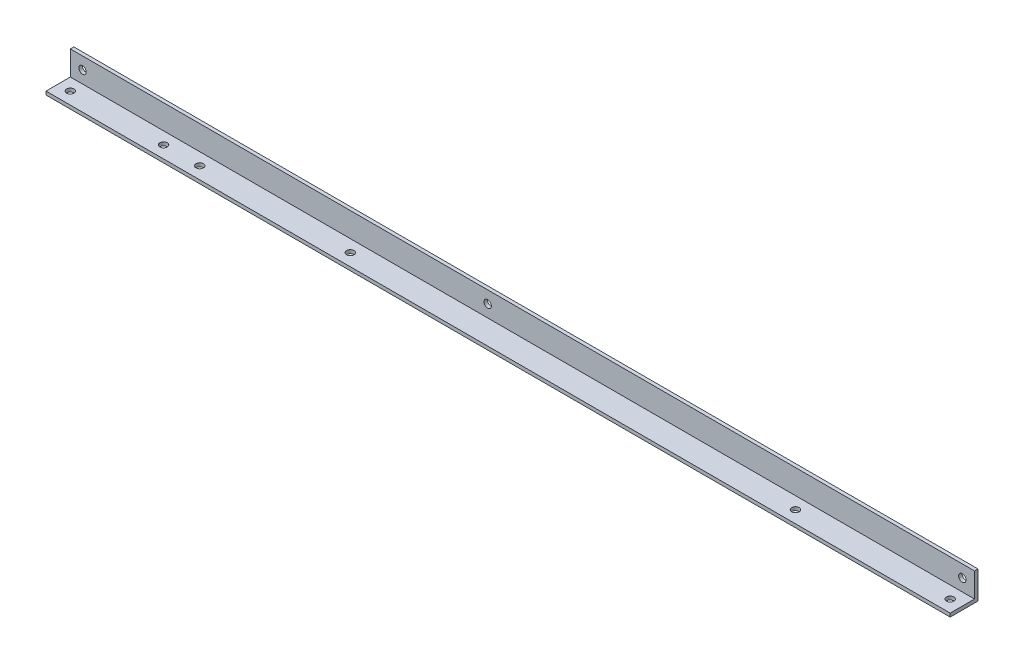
ISO-10303-21;
HEADER;
FILE_DESCRIPTION(('STEP AP214'),'2;1');
FILE_NAME('part.step','',(''),(''),'','','');
FILE_SCHEMA(('AUTOMOTIVE_DESIGN { 1 0 10303 214 1 1 1 1 }'));
ENDSEC;
DATA;
#1=APPLICATION_CONTEXT('core data for automotive mechanical design processes');
#2=APPLICATION_PROTOCOL_DEFINITION('international standard','automotive_design',2000,#1);
#3=PRODUCT_CONTEXT('',#1,'mechanical');
#4=PRODUCT('Part','Part','',(#3));
#5=PRODUCT_RELATED_PRODUCT_CATEGORY('part','',(#4));
#6=PRODUCT_DEFINITION_FORMATION('','',#4);
#7=PRODUCT_DEFINITION_CONTEXT('part definition',#1,'design');
#8=PRODUCT_DEFINITION('design','',#6,#7);
#9=PRODUCT_DEFINITION_SHAPE('','',#8);
#10=(LENGTH_UNIT() NAMED_UNIT(*) SI_UNIT(.MILLI.,.METRE.));
#11=(NAMED_UNIT(*) PLANE_ANGLE_UNIT() SI_UNIT($,.RADIAN.));
#12=(NAMED_UNIT(*) SI_UNIT($,.STERADIAN.) SOLID_ANGLE_UNIT());
#13=UNCERTAINTY_MEASURE_WITH_UNIT(LENGTH_MEASURE(1.E-05),#10,'distance_accuracy_value','');
#14=(GEOMETRIC_REPRESENTATION_CONTEXT(3) GLOBAL_UNCERTAINTY_ASSIGNED_CONTEXT((#13)) GLOBAL_UNIT_ASSIGNED_CONTEXT((#10,
#11,#12)) REPRESENTATION_CONTEXT('',''));
#15=CARTESIAN_POINT('',(0.,0.,0.));
#16=DIRECTION('',(0.,0.,1.));
#17=DIRECTION('',(1.,0.,0.));
#18=AXIS2_PLACEMENT_3D('',#15,#16,#17);
#19=CARTESIAN_POINT('',(412.75,3.175,-12.7));
#20=DIRECTION('',(-1.,0.,0.));
#21=DIRECTION('',(0.,0.,1.));
#22=AXIS2_PLACEMENT_3D('',#19,#20,#21);
#23=PLANE('',#22);
#24=DIRECTION('',(0.,0.,-1.));
#25=VECTOR('',#24,1.);
#26=CARTESIAN_POINT('',(412.75,0.,-12.7));
#27=LINE('',#26,#25);
#28=CARTESIAN_POINT('',(412.75,0.,12.7));
#29=VERTEX_POINT('',#28);
#30=CARTESIAN_POINT('',(412.75,0.,-12.7));
#31=VERTEX_POINT('',#30);
#32=EDGE_CURVE('E89',#29,#31,#27,.T.);
#33=ORIENTED_EDGE('',*,*,#32,.T.);
#34=DIRECTION('',(0.,-1.,0.));
#35=VECTOR('',#34,1.);
#36=CARTESIAN_POINT('',(412.75,3.175,-12.7));
#37=LINE('',#36,#35);
#38=CARTESIAN_POINT('',(412.75,25.4,-12.7));
#39=VERTEX_POINT('',#38);
#40=EDGE_CURVE('E11',#39,#31,#37,.T.);
#41=ORIENTED_EDGE('',*,*,#40,.F.);
#42=DIRECTION('',(0.,0.,-1.));
#43=VECTOR('',#42,1.);
#44=CARTESIAN_POINT('',(412.75,25.4,-9.525));
#45=LINE('',#44,#43);
#46=CARTESIAN_POINT('',(412.75,25.4,-9.525));
#47=VERTEX_POINT('',#46);
#48=EDGE_CURVE('E115',#47,#39,#45,.T.);
#49=ORIENTED_EDGE('',*,*,#48,.F.);
#50=DIRECTION('',(0.,-1.,0.));
#51=VECTOR('',#50,1.);
#52=CARTESIAN_POINT('',(412.75,25.4,-9.525));
#53=LINE('',#52,#51);
#54=CARTESIAN_POINT('',(412.75,3.175,-9.525));
#55=VERTEX_POINT('',#54);
#56=EDGE_CURVE('E98',#47,#55,#53,.T.);
#57=ORIENTED_EDGE('',*,*,#56,.T.);
#58=DIRECTION('',(0.,0.,-1.));
#59=VECTOR('',#58,1.);
#60=CARTESIAN_POINT('',(412.75,3.175,-12.7));
#61=LINE('',#60,#59);
#62=CARTESIAN_POINT('',(412.75,3.175,12.7));
#63=VERTEX_POINT('',#62);
#64=EDGE_CURVE('E83',#63,#55,#61,.T.);
#65=ORIENTED_EDGE('',*,*,#64,.F.);
#66=DIRECTION('',(0.,-1.,0.));
#67=VECTOR('',#66,1.);
#68=CARTESIAN_POINT('',(412.75,3.175,12.7));
#69=LINE('',#68,#67);
#70=EDGE_CURVE('E76',#63,#29,#69,.T.);
#71=ORIENTED_EDGE('',*,*,#70,.T.);
#72=EDGE_LOOP('',(#33,#41,#49,#57,#65,#71));
#73=FACE_BOUND('',#72,.T.);
#74=ADVANCED_FACE('F32',(#73),#23,.F.);
#75=CARTESIAN_POINT('',(-412.75,3.175,-12.7));
#76=DIRECTION('',(0.,0.,1.));
#77=DIRECTION('',(1.,0.,0.));
#78=AXIS2_PLACEMENT_3D('',#75,#76,#77);
#79=PLANE('',#78);
#80=CARTESIAN_POINT('',(-31.75,14.2875,-12.7));
#81=DIRECTION('',(0.,0.,1.));
#82=DIRECTION('',(1.,0.,0.));
#83=AXIS2_PLACEMENT_3D('',#80,#81,#82);
#84=CIRCLE('',#83,3.37819999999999);
#85=CARTESIAN_POINT('',(-28.3718,14.2875,-12.7));
#86=VERTEX_POINT('',#85);
#87=EDGE_CURVE('E183',#86,#86,#84,.T.);
#88=ORIENTED_EDGE('',*,*,#87,.T.);
#89=EDGE_LOOP('',(#88));
#90=FACE_BOUND('',#89,.T.);
#91=CARTESIAN_POINT('',(401.6375,14.2875,-12.7));
#92=DIRECTION('',(0.,0.,1.));
#93=DIRECTION('',(1.,0.,0.));
#94=AXIS2_PLACEMENT_3D('',#91,#92,#93);
#95=CIRCLE('',#94,3.37819999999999);
#96=CARTESIAN_POINT('',(405.0157,14.2875,-12.7));
#97=VERTEX_POINT('',#96);
#98=EDGE_CURVE('E177',#97,#97,#95,.T.);
#99=ORIENTED_EDGE('',*,*,#98,.T.);
#100=EDGE_LOOP('',(#99));
#101=FACE_BOUND('',#100,.T.);
#102=CARTESIAN_POINT('',(-401.6375,14.2875,-12.7));
#103=DIRECTION('',(0.,0.,1.));
#104=DIRECTION('',(1.,0.,0.));
#105=AXIS2_PLACEMENT_3D('',#102,#103,#104);
#106=CIRCLE('',#105,3.37819999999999);
#107=CARTESIAN_POINT('',(-398.2593,14.2875,-12.7));
#108=VERTEX_POINT('',#107);
#109=EDGE_CURVE('E171',#108,#108,#106,.T.);
#110=ORIENTED_EDGE('',*,*,#109,.T.);
#111=EDGE_LOOP('',(#110));
#112=FACE_BOUND('',#111,.T.);
#113=DIRECTION('',(-1.,0.,0.));
#114=VECTOR('',#113,1.);
#115=CARTESIAN_POINT('',(-412.75,0.,-12.7));
#116=LINE('',#115,#114);
#117=CARTESIAN_POINT('',(-412.75,0.,-12.7));
#118=VERTEX_POINT('',#117);
#119=EDGE_CURVE('E93',#31,#118,#116,.T.);
#120=ORIENTED_EDGE('',*,*,#119,.T.);
#121=DIRECTION('',(0.,-1.,0.));
#122=VECTOR('',#121,1.);
#123=CARTESIAN_POINT('',(-412.75,3.175,-12.7));
#124=LINE('',#123,#122);
#125=CARTESIAN_POINT('',(-412.75,25.4,-12.7));
#126=VERTEX_POINT('',#125);
#127=EDGE_CURVE('E40',#126,#118,#124,.T.);
#128=ORIENTED_EDGE('',*,*,#127,.F.);
#129=DIRECTION('',(-1.,0.,0.));
#130=VECTOR('',#129,1.);
#131=CARTESIAN_POINT('',(412.75,25.4,-12.7));
#132=LINE('',#131,#130);
#133=EDGE_CURVE('E118',#39,#126,#132,.T.);
#134=ORIENTED_EDGE('',*,*,#133,.F.);
#135=ORIENTED_EDGE('',*,*,#40,.T.);
#136=EDGE_LOOP('',(#120,#128,#134,#135));
#137=FACE_BOUND('',#136,.T.);
#138=ADVANCED_FACE('F192',(#90,#101,#112,#137),#79,.F.);
#139=CARTESIAN_POINT('',(-412.75,3.175,-12.7));
#140=DIRECTION('',(1.,0.,0.));
#141=DIRECTION('',(0.,0.,-1.));
#142=AXIS2_PLACEMENT_3D('',#139,#140,#141);
#143=PLANE('',#142);
#144=DIRECTION('',(0.,0.,1.));
#145=VECTOR('',#144,1.);
#146=CARTESIAN_POINT('',(-412.75,0.,-12.7));
#147=LINE('',#146,#145);
#148=CARTESIAN_POINT('',(-412.75,0.,12.7));
#149=VERTEX_POINT('',#148);
#150=EDGE_CURVE('E84',#118,#149,#147,.T.);
#151=ORIENTED_EDGE('',*,*,#150,.T.);
#152=DIRECTION('',(0.,-1.,0.));
#153=VECTOR('',#152,1.);
#154=CARTESIAN_POINT('',(-412.75,3.175,12.7));
#155=LINE('',#154,#153);
#156=CARTESIAN_POINT('',(-412.75,3.175,12.7));
#157=VERTEX_POINT('',#156);
#158=EDGE_CURVE('E79',#157,#149,#155,.T.);
#159=ORIENTED_EDGE('',*,*,#158,.F.);
#160=DIRECTION('',(0.,0.,1.));
#161=VECTOR('',#160,1.);
#162=CARTESIAN_POINT('',(-412.75,3.175,-12.7));
#163=LINE('',#162,#161);
#164=CARTESIAN_POINT('',(-412.75,3.175,-9.525));
#165=VERTEX_POINT('',#164);
#166=EDGE_CURVE('E108',#165,#157,#163,.T.);
#167=ORIENTED_EDGE('',*,*,#166,.F.);
#168=DIRECTION('',(0.,-1.,0.));
#169=VECTOR('',#168,1.);
#170=CARTESIAN_POINT('',(-412.75,25.4,-9.525));
#171=LINE('',#170,#169);
#172=CARTESIAN_POINT('',(-412.75,25.4,-9.525));
#173=VERTEX_POINT('',#172);
#174=EDGE_CURVE('E94',#173,#165,#171,.T.);
#175=ORIENTED_EDGE('',*,*,#174,.F.);
#176=DIRECTION('',(0.,0.,1.));
#177=VECTOR('',#176,1.);
#178=CARTESIAN_POINT('',(-412.75,25.4,-12.7));
#179=LINE('',#178,#177);
#180=EDGE_CURVE('E131',#126,#173,#179,.T.);
#181=ORIENTED_EDGE('',*,*,#180,.F.);
#182=ORIENTED_EDGE('',*,*,#127,.T.);
#183=EDGE_LOOP('',(#151,#159,#167,#175,#181,#182));
#184=FACE_BOUND('',#183,.T.);
#185=ADVANCED_FACE('F221',(#184),#143,.F.);
#186=CARTESIAN_POINT('',(-412.75,3.175,12.7));
#187=DIRECTION('',(0.,0.,-1.));
#188=DIRECTION('',(-1.,0.,0.));
#189=AXIS2_PLACEMENT_3D('',#186,#187,#188);
#190=PLANE('',#189);
#191=DIRECTION('',(1.,0.,0.));
#192=VECTOR('',#191,1.);
#193=CARTESIAN_POINT('',(-412.75,0.,12.7));
#194=LINE('',#193,#192);
#195=EDGE_CURVE('E73',#149,#29,#194,.T.);
#196=ORIENTED_EDGE('',*,*,#195,.T.);
#197=ORIENTED_EDGE('',*,*,#70,.F.);
#198=DIRECTION('',(1.,0.,0.));
#199=VECTOR('',#198,1.);
#200=CARTESIAN_POINT('',(-412.75,3.175,12.7));
#201=LINE('',#200,#199);
#202=EDGE_CURVE('E54',#157,#63,#201,.T.);
#203=ORIENTED_EDGE('',*,*,#202,.F.);
#204=ORIENTED_EDGE('',*,*,#158,.T.);
#205=EDGE_LOOP('',(#196,#197,#203,#204));
#206=FACE_BOUND('',#205,.T.);
#207=ADVANCED_FACE('F75',(#206),#190,.F.);
#208=CARTESIAN_POINT('',(412.75,3.175,12.7));
#209=DIRECTION('',(0.,1.,0.));
#210=DIRECTION('',(0.,0.,1.));
#211=AXIS2_PLACEMENT_3D('',#208,#209,#210);
#212=PLANE('',#211);
#213=CARTESIAN_POINT('',(-146.05,3.175,1.5875));
#214=DIRECTION('',(0.,1.,0.));
#215=DIRECTION('',(0.,0.,1.));
#216=AXIS2_PLACEMENT_3D('',#213,#214,#215);
#217=CIRCLE('',#216,3.37819999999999);
#218=CARTESIAN_POINT('',(-146.05,3.175,4.96569999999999));
#219=VERTEX_POINT('',#218);
#220=EDGE_CURVE('E168',#219,#219,#217,.T.);
#221=ORIENTED_EDGE('',*,*,#220,.F.);
#222=EDGE_LOOP('',(#221));
#223=FACE_BOUND('',#222,.T.);
#224=CARTESIAN_POINT('',(-283.5275,3.175,1.5875));
#225=DIRECTION('',(0.,1.,0.));
#226=DIRECTION('',(0.,0.,1.));
#227=AXIS2_PLACEMENT_3D('',#224,#225,#226);
#228=CIRCLE('',#227,3.37819999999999);
#229=CARTESIAN_POINT('',(-283.5275,3.175,4.96569999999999));
#230=VERTEX_POINT('',#229);
#231=EDGE_CURVE('E162',#230,#230,#228,.T.);
#232=ORIENTED_EDGE('',*,*,#231,.F.);
#233=EDGE_LOOP('',(#232));
#234=FACE_BOUND('',#233,.T.);
#235=CARTESIAN_POINT('',(260.35,3.175,1.5875));
#236=DIRECTION('',(0.,1.,0.));
#237=DIRECTION('',(0.,0.,1.));
#238=AXIS2_PLACEMENT_3D('',#235,#236,#237);
#239=CIRCLE('',#238,3.37819999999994);
#240=CARTESIAN_POINT('',(260.35,3.175,4.96569999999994));
#241=VERTEX_POINT('',#240);
#242=EDGE_CURVE('E156',#241,#241,#239,.T.);
#243=ORIENTED_EDGE('',*,*,#242,.F.);
#244=EDGE_LOOP('',(#243));
#245=FACE_BOUND('',#244,.T.);
#246=CARTESIAN_POINT('',(401.6375,3.175,1.5875));
#247=DIRECTION('',(0.,1.,0.));
#248=DIRECTION('',(0.,0.,1.));
#249=AXIS2_PLACEMENT_3D('',#246,#247,#248);
#250=CIRCLE('',#249,3.37819999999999);
#251=CARTESIAN_POINT('',(401.6375,3.175,4.96569999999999));
#252=VERTEX_POINT('',#251);
#253=EDGE_CURVE('E150',#252,#252,#250,.T.);
#254=ORIENTED_EDGE('',*,*,#253,.F.);
#255=EDGE_LOOP('',(#254));
#256=FACE_BOUND('',#255,.T.);
#257=CARTESIAN_POINT('',(-316.5475,3.175,1.5875));
#258=DIRECTION('',(0.,1.,0.));
#259=DIRECTION('',(0.,0.,1.));
#260=AXIS2_PLACEMENT_3D('',#257,#258,#259);
#261=CIRCLE('',#260,3.37819999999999);
#262=CARTESIAN_POINT('',(-316.5475,3.175,4.96569999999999));
#263=VERTEX_POINT('',#262);
#264=EDGE_CURVE('E144',#263,#263,#261,.T.);
#265=ORIENTED_EDGE('',*,*,#264,.F.);
#266=EDGE_LOOP('',(#265));
#267=FACE_BOUND('',#266,.T.);
#268=CARTESIAN_POINT('',(-401.6375,3.175,1.5875));
#269=DIRECTION('',(0.,1.,0.));
#270=DIRECTION('',(0.,0.,1.));
#271=AXIS2_PLACEMENT_3D('',#268,#269,#270);
#272=CIRCLE('',#271,3.37819999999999);
#273=CARTESIAN_POINT('',(-401.6375,3.175,4.96569999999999));
#274=VERTEX_POINT('',#273);
#275=EDGE_CURVE('E138',#274,#274,#272,.T.);
#276=ORIENTED_EDGE('',*,*,#275,.F.);
#277=EDGE_LOOP('',(#276));
#278=FACE_BOUND('',#277,.T.);
#279=DIRECTION('',(1.,0.,0.));
#280=VECTOR('',#279,1.);
#281=CARTESIAN_POINT('',(-412.75,3.175,-9.525));
#282=LINE('',#281,#280);
#283=EDGE_CURVE('E48',#165,#55,#282,.T.);
#284=ORIENTED_EDGE('',*,*,#283,.F.);
#285=ORIENTED_EDGE('',*,*,#166,.T.);
#286=ORIENTED_EDGE('',*,*,#202,.T.);
#287=ORIENTED_EDGE('',*,*,#64,.T.);
#288=EDGE_LOOP('',(#284,#285,#286,#287));
#289=FACE_BOUND('',#288,.T.);
#290=ADVANCED_FACE('F222',(#223,#234,#245,#256,#267,#278,#289),#212,.T.);
#291=CARTESIAN_POINT('',(412.75,0.,12.7));
#292=DIRECTION('',(0.,1.,0.));
#293=DIRECTION('',(0.,0.,1.));
#294=AXIS2_PLACEMENT_3D('',#291,#292,#293);
#295=PLANE('',#294);
#296=CARTESIAN_POINT('',(-146.05,0.,1.5875));
#297=DIRECTION('',(0.,1.,0.));
#298=DIRECTION('',(0.,0.,1.));
#299=AXIS2_PLACEMENT_3D('',#296,#297,#298);
#300=CIRCLE('',#299,3.37819999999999);
#301=CARTESIAN_POINT('',(-146.05,0.,4.96569999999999));
#302=VERTEX_POINT('',#301);
#303=EDGE_CURVE('E165',#302,#302,#300,.T.);
#304=ORIENTED_EDGE('',*,*,#303,.T.);
#305=EDGE_LOOP('',(#304));
#306=FACE_BOUND('',#305,.T.);
#307=CARTESIAN_POINT('',(-283.5275,0.,1.5875));
#308=DIRECTION('',(0.,1.,0.));
#309=DIRECTION('',(0.,0.,1.));
#310=AXIS2_PLACEMENT_3D('',#307,#308,#309);
#311=CIRCLE('',#310,3.37819999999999);
#312=CARTESIAN_POINT('',(-283.5275,0.,4.96569999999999));
#313=VERTEX_POINT('',#312);
#314=EDGE_CURVE('E159',#313,#313,#311,.T.);
#315=ORIENTED_EDGE('',*,*,#314,.T.);
#316=EDGE_LOOP('',(#315));
#317=FACE_BOUND('',#316,.T.);
#318=CARTESIAN_POINT('',(260.35,0.,1.5875));
#319=DIRECTION('',(0.,1.,0.));
#320=DIRECTION('',(0.,0.,1.));
#321=AXIS2_PLACEMENT_3D('',#318,#319,#320);
#322=CIRCLE('',#321,3.37819999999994);
#323=CARTESIAN_POINT('',(260.35,0.,4.96569999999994));
#324=VERTEX_POINT('',#323);
#325=EDGE_CURVE('E153',#324,#324,#322,.T.);
#326=ORIENTED_EDGE('',*,*,#325,.T.);
#327=EDGE_LOOP('',(#326));
#328=FACE_BOUND('',#327,.T.);
#329=CARTESIAN_POINT('',(401.6375,0.,1.5875));
#330=DIRECTION('',(0.,1.,0.));
#331=DIRECTION('',(0.,0.,1.));
#332=AXIS2_PLACEMENT_3D('',#329,#330,#331);
#333=CIRCLE('',#332,3.37819999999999);
#334=CARTESIAN_POINT('',(401.6375,0.,4.96569999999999));
#335=VERTEX_POINT('',#334);
#336=EDGE_CURVE('E147',#335,#335,#333,.T.);
#337=ORIENTED_EDGE('',*,*,#336,.T.);
#338=EDGE_LOOP('',(#337));
#339=FACE_BOUND('',#338,.T.);
#340=CARTESIAN_POINT('',(-316.5475,0.,1.5875));
#341=DIRECTION('',(0.,1.,0.));
#342=DIRECTION('',(0.,0.,1.));
#343=AXIS2_PLACEMENT_3D('',#340,#341,#342);
#344=CIRCLE('',#343,3.37819999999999);
#345=CARTESIAN_POINT('',(-316.5475,0.,4.96569999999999));
#346=VERTEX_POINT('',#345);
#347=EDGE_CURVE('E141',#346,#346,#344,.T.);
#348=ORIENTED_EDGE('',*,*,#347,.T.);
#349=EDGE_LOOP('',(#348));
#350=FACE_BOUND('',#349,.T.);
#351=CARTESIAN_POINT('',(-401.6375,0.,1.5875));
#352=DIRECTION('',(0.,1.,0.));
#353=DIRECTION('',(0.,0.,1.));
#354=AXIS2_PLACEMENT_3D('',#351,#352,#353);
#355=CIRCLE('',#354,3.37819999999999);
#356=CARTESIAN_POINT('',(-401.6375,0.,4.96569999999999));
#357=VERTEX_POINT('',#356);
#358=EDGE_CURVE('E119',#357,#357,#355,.T.);
#359=ORIENTED_EDGE('',*,*,#358,.T.);
#360=EDGE_LOOP('',(#359));
#361=FACE_BOUND('',#360,.T.);
#362=ORIENTED_EDGE('',*,*,#32,.F.);
#363=ORIENTED_EDGE('',*,*,#195,.F.);
#364=ORIENTED_EDGE('',*,*,#150,.F.);
#365=ORIENTED_EDGE('',*,*,#119,.F.);
#366=EDGE_LOOP('',(#362,#363,#364,#365));
#367=FACE_BOUND('',#366,.T.);
#368=ADVANCED_FACE('F92',(#306,#317,#328,#339,#350,#361,#367),#295,.F.);
#369=CARTESIAN_POINT('',(-412.75,25.4,-9.525));
#370=DIRECTION('',(0.,0.,-1.));
#371=DIRECTION('',(-1.,0.,0.));
#372=AXIS2_PLACEMENT_3D('',#369,#370,#371);
#373=PLANE('',#372);
#374=CARTESIAN_POINT('',(-31.75,14.2875,-9.525));
#375=DIRECTION('',(0.,0.,1.));
#376=DIRECTION('',(1.,0.,0.));
#377=AXIS2_PLACEMENT_3D('',#374,#375,#376);
#378=CIRCLE('',#377,3.37819999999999);
#379=CARTESIAN_POINT('',(-28.3718,14.2875,-9.525));
#380=VERTEX_POINT('',#379);
#381=EDGE_CURVE('E186',#380,#380,#378,.T.);
#382=ORIENTED_EDGE('',*,*,#381,.F.);
#383=EDGE_LOOP('',(#382));
#384=FACE_BOUND('',#383,.T.);
#385=CARTESIAN_POINT('',(401.6375,14.2875,-9.525));
#386=DIRECTION('',(0.,0.,1.));
#387=DIRECTION('',(1.,0.,0.));
#388=AXIS2_PLACEMENT_3D('',#385,#386,#387);
#389=CIRCLE('',#388,3.37819999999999);
#390=CARTESIAN_POINT('',(405.0157,14.2875,-9.525));
#391=VERTEX_POINT('',#390);
#392=EDGE_CURVE('E180',#391,#391,#389,.T.);
#393=ORIENTED_EDGE('',*,*,#392,.F.);
#394=EDGE_LOOP('',(#393));
#395=FACE_BOUND('',#394,.T.);
#396=CARTESIAN_POINT('',(-401.6375,14.2875,-9.525));
#397=DIRECTION('',(0.,0.,1.));
#398=DIRECTION('',(1.,0.,0.));
#399=AXIS2_PLACEMENT_3D('',#396,#397,#398);
#400=CIRCLE('',#399,3.37819999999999);
#401=CARTESIAN_POINT('',(-398.2593,14.2875,-9.525));
#402=VERTEX_POINT('',#401);
#403=EDGE_CURVE('E174',#402,#402,#400,.T.);
#404=ORIENTED_EDGE('',*,*,#403,.F.);
#405=EDGE_LOOP('',(#404));
#406=FACE_BOUND('',#405,.T.);
#407=ORIENTED_EDGE('',*,*,#283,.T.);
#408=ORIENTED_EDGE('',*,*,#56,.F.);
#409=DIRECTION('',(1.,0.,0.));
#410=VECTOR('',#409,1.);
#411=CARTESIAN_POINT('',(-412.75,25.4,-9.525));
#412=LINE('',#411,#410);
#413=EDGE_CURVE('E126',#173,#47,#412,.T.);
#414=ORIENTED_EDGE('',*,*,#413,.F.);
#415=ORIENTED_EDGE('',*,*,#174,.T.);
#416=EDGE_LOOP('',(#407,#408,#414,#415));
#417=FACE_BOUND('',#416,.T.);
#418=ADVANCED_FACE('F202',(#384,#395,#406,#417),#373,.F.);
#419=CARTESIAN_POINT('',(-412.75,25.4,-12.7));
#420=DIRECTION('',(0.,1.,0.));
#421=DIRECTION('',(0.,0.,1.));
#422=AXIS2_PLACEMENT_3D('',#419,#420,#421);
#423=PLANE('',#422);
#424=ORIENTED_EDGE('',*,*,#133,.T.);
#425=ORIENTED_EDGE('',*,*,#180,.T.);
#426=ORIENTED_EDGE('',*,*,#413,.T.);
#427=ORIENTED_EDGE('',*,*,#48,.T.);
#428=EDGE_LOOP('',(#424,#425,#426,#427));
#429=FACE_BOUND('',#428,.T.);
#430=ADVANCED_FACE('F205',(#429),#423,.T.);
#431=CARTESIAN_POINT('',(-401.6375,0.,1.5875));
#432=DIRECTION('',(0.,1.,0.));
#433=DIRECTION('',(0.,0.,1.));
#434=AXIS2_PLACEMENT_3D('',#431,#432,#433);
#435=CYLINDRICAL_SURFACE('',#434,3.37819999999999);
#436=ORIENTED_EDGE('',*,*,#358,.F.);
#437=EDGE_LOOP('',(#436));
#438=FACE_BOUND('',#437,.T.);
#439=ORIENTED_EDGE('',*,*,#275,.T.);
#440=EDGE_LOOP('',(#439));
#441=FACE_BOUND('',#440,.T.);
#442=ADVANCED_FACE('F290',(#438,#441),#435,.F.);
#443=CARTESIAN_POINT('',(-316.5475,0.,1.5875));
#444=DIRECTION('',(0.,1.,0.));
#445=DIRECTION('',(0.,0.,1.));
#446=AXIS2_PLACEMENT_3D('',#443,#444,#445);
#447=CYLINDRICAL_SURFACE('',#446,3.37819999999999);
#448=ORIENTED_EDGE('',*,*,#347,.F.);
#449=EDGE_LOOP('',(#448));
#450=FACE_BOUND('',#449,.T.);
#451=ORIENTED_EDGE('',*,*,#264,.T.);
#452=EDGE_LOOP('',(#451));
#453=FACE_BOUND('',#452,.T.);
#454=ADVANCED_FACE('F298',(#450,#453),#447,.F.);
#455=CARTESIAN_POINT('',(401.6375,0.,1.5875));
#456=DIRECTION('',(0.,1.,0.));
#457=DIRECTION('',(0.,0.,1.));
#458=AXIS2_PLACEMENT_3D('',#455,#456,#457);
#459=CYLINDRICAL_SURFACE('',#458,3.37819999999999);
#460=ORIENTED_EDGE('',*,*,#336,.F.);
#461=EDGE_LOOP('',(#460));
#462=FACE_BOUND('',#461,.T.);
#463=ORIENTED_EDGE('',*,*,#253,.T.);
#464=EDGE_LOOP('',(#463));
#465=FACE_BOUND('',#464,.T.);
#466=ADVANCED_FACE('F307',(#462,#465),#459,.F.);
#467=CARTESIAN_POINT('',(260.35,0.,1.5875));
#468=DIRECTION('',(0.,1.,0.));
#469=DIRECTION('',(0.,0.,1.));
#470=AXIS2_PLACEMENT_3D('',#467,#468,#469);
#471=CYLINDRICAL_SURFACE('',#470,3.37819999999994);
#472=ORIENTED_EDGE('',*,*,#325,.F.);
#473=EDGE_LOOP('',(#472));
#474=FACE_BOUND('',#473,.T.);
#475=ORIENTED_EDGE('',*,*,#242,.T.);
#476=EDGE_LOOP('',(#475));
#477=FACE_BOUND('',#476,.T.);
#478=ADVANCED_FACE('F316',(#474,#477),#471,.F.);
#479=CARTESIAN_POINT('',(-283.5275,0.,1.5875));
#480=DIRECTION('',(0.,1.,0.));
#481=DIRECTION('',(0.,0.,1.));
#482=AXIS2_PLACEMENT_3D('',#479,#480,#481);
#483=CYLINDRICAL_SURFACE('',#482,3.37819999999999);
#484=ORIENTED_EDGE('',*,*,#314,.F.);
#485=EDGE_LOOP('',(#484));
#486=FACE_BOUND('',#485,.T.);
#487=ORIENTED_EDGE('',*,*,#231,.T.);
#488=EDGE_LOOP('',(#487));
#489=FACE_BOUND('',#488,.T.);
#490=ADVANCED_FACE('F325',(#486,#489),#483,.F.);
#491=CARTESIAN_POINT('',(-146.05,0.,1.5875));
#492=DIRECTION('',(0.,1.,0.));
#493=DIRECTION('',(0.,0.,1.));
#494=AXIS2_PLACEMENT_3D('',#491,#492,#493);
#495=CYLINDRICAL_SURFACE('',#494,3.37819999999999);
#496=ORIENTED_EDGE('',*,*,#303,.F.);
#497=EDGE_LOOP('',(#496));
#498=FACE_BOUND('',#497,.T.);
#499=ORIENTED_EDGE('',*,*,#220,.T.);
#500=EDGE_LOOP('',(#499));
#501=FACE_BOUND('',#500,.T.);
#502=ADVANCED_FACE('F334',(#498,#501),#495,.F.);
#503=CARTESIAN_POINT('',(-401.6375,14.2875,-12.7));
#504=DIRECTION('',(0.,0.,1.));
#505=DIRECTION('',(1.,0.,0.));
#506=AXIS2_PLACEMENT_3D('',#503,#504,#505);
#507=CYLINDRICAL_SURFACE('',#506,3.37819999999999);
#508=ORIENTED_EDGE('',*,*,#109,.F.);
#509=EDGE_LOOP('',(#508));
#510=FACE_BOUND('',#509,.T.);
#511=ORIENTED_EDGE('',*,*,#403,.T.);
#512=EDGE_LOOP('',(#511));
#513=FACE_BOUND('',#512,.T.);
#514=ADVANCED_FACE('F342',(#510,#513),#507,.F.);
#515=CARTESIAN_POINT('',(401.6375,14.2875,-12.7));
#516=DIRECTION('',(0.,0.,1.));
#517=DIRECTION('',(1.,0.,0.));
#518=AXIS2_PLACEMENT_3D('',#515,#516,#517);
#519=CYLINDRICAL_SURFACE('',#518,3.37819999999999);
#520=ORIENTED_EDGE('',*,*,#98,.F.);
#521=EDGE_LOOP('',(#520));
#522=FACE_BOUND('',#521,.T.);
#523=ORIENTED_EDGE('',*,*,#392,.T.);
#524=EDGE_LOOP('',(#523));
#525=FACE_BOUND('',#524,.T.);
#526=ADVANCED_FACE('F198',(#522,#525),#519,.F.);
#527=CARTESIAN_POINT('',(-31.75,14.2875,-12.7));
#528=DIRECTION('',(0.,0.,1.));
#529=DIRECTION('',(1.,0.,0.));
#530=AXIS2_PLACEMENT_3D('',#527,#528,#529);
#531=CYLINDRICAL_SURFACE('',#530,3.37819999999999);
#532=ORIENTED_EDGE('',*,*,#87,.F.);
#533=EDGE_LOOP('',(#532));
#534=FACE_BOUND('',#533,.T.);
#535=ORIENTED_EDGE('',*,*,#381,.T.);
#536=EDGE_LOOP('',(#535));
#537=FACE_BOUND('',#536,.T.);
#538=ADVANCED_FACE('F195',(#534,#537),#531,.F.);
#539=CLOSED_SHELL('',(#74,#138,#185,#207,#290,#368,#418,#430,#442,#454,#466,#478,#490,#502,#514,
#526,#538));
#540=MANIFOLD_SOLID_BREP('B2',#539);
#541=ADVANCED_BREP_SHAPE_REPRESENTATION('',(#18,#540),#14);
#542=SHAPE_DEFINITION_REPRESENTATION(#9,#541);
ENDSEC;
END-ISO-10303-21;
